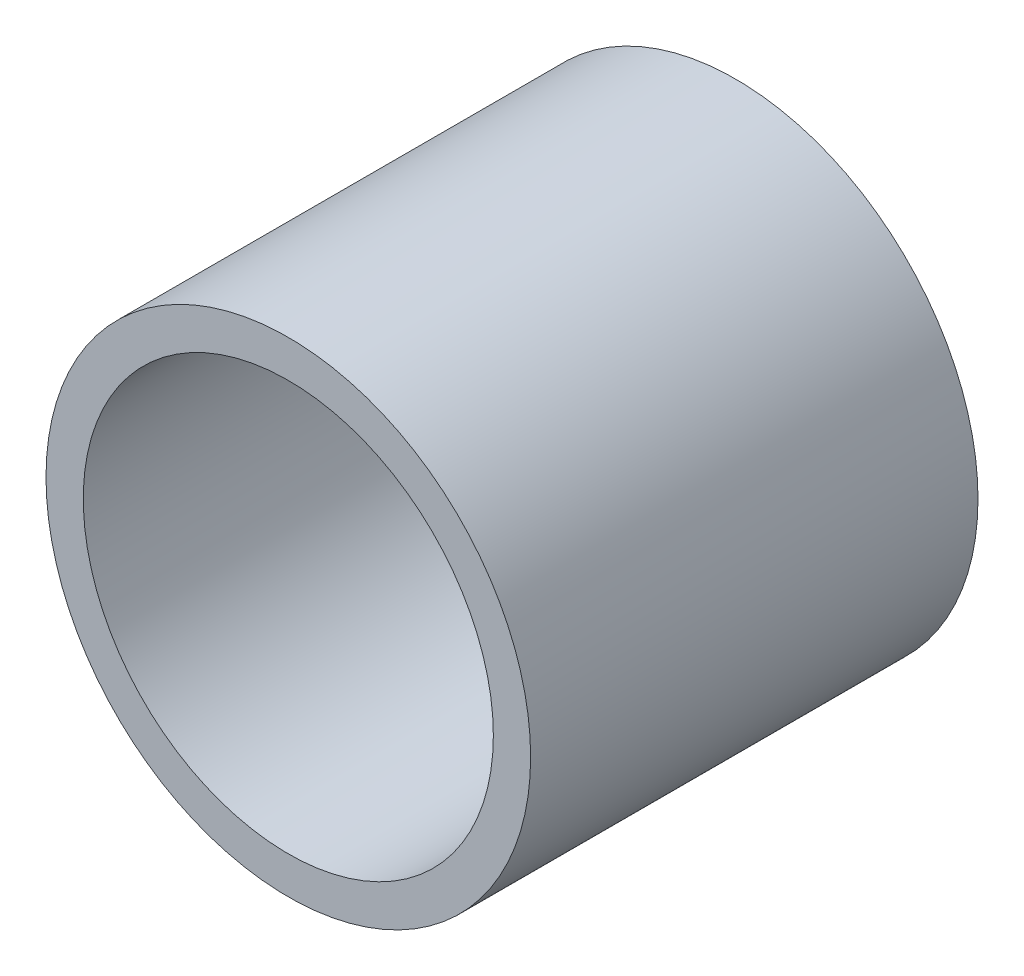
ISO-10303-21;
HEADER;
FILE_DESCRIPTION(('STEP AP214'),'2;1');
FILE_NAME('part.step','',(''),(''),'','','');
FILE_SCHEMA(('AUTOMOTIVE_DESIGN { 1 0 10303 214 1 1 1 1 }'));
ENDSEC;
DATA;
#1=APPLICATION_CONTEXT('core data for automotive mechanical design processes');
#2=APPLICATION_PROTOCOL_DEFINITION('international standard','automotive_design',2000,#1);
#3=PRODUCT_CONTEXT('',#1,'mechanical');
#4=PRODUCT('Part','Part','',(#3));
#5=PRODUCT_RELATED_PRODUCT_CATEGORY('part','',(#4));
#6=PRODUCT_DEFINITION_FORMATION('','',#4);
#7=PRODUCT_DEFINITION_CONTEXT('part definition',#1,'design');
#8=PRODUCT_DEFINITION('design','',#6,#7);
#9=PRODUCT_DEFINITION_SHAPE('','',#8);
#10=(LENGTH_UNIT() NAMED_UNIT(*) SI_UNIT(.MILLI.,.METRE.));
#11=(NAMED_UNIT(*) PLANE_ANGLE_UNIT() SI_UNIT($,.RADIAN.));
#12=(NAMED_UNIT(*) SI_UNIT($,.STERADIAN.) SOLID_ANGLE_UNIT());
#13=UNCERTAINTY_MEASURE_WITH_UNIT(LENGTH_MEASURE(1.E-05),#10,'distance_accuracy_value','');
#14=(GEOMETRIC_REPRESENTATION_CONTEXT(3) GLOBAL_UNCERTAINTY_ASSIGNED_CONTEXT((#13)) GLOBAL_UNIT_ASSIGNED_CONTEXT((#10,
#11,#12)) REPRESENTATION_CONTEXT('',''));
#15=CARTESIAN_POINT('',(0.,0.,0.));
#16=DIRECTION('',(0.,0.,1.));
#17=DIRECTION('',(1.,0.,0.));
#18=AXIS2_PLACEMENT_3D('',#15,#16,#17);
#19=CARTESIAN_POINT('',(0.,0.,24.));
#20=DIRECTION('',(0.,0.,1.));
#21=DIRECTION('',(1.,0.,0.));
#22=AXIS2_PLACEMENT_3D('',#19,#20,#21);
#23=PLANE('',#22);
#24=CARTESIAN_POINT('',(0.,0.,24.));
#25=DIRECTION('',(0.,0.,1.));
#26=DIRECTION('',(1.,0.,0.));
#27=AXIS2_PLACEMENT_3D('',#24,#25,#26);
#28=CIRCLE('',#27,13.);
#29=CARTESIAN_POINT('',(13.,0.,24.));
#30=VERTEX_POINT('',#29);
#31=EDGE_CURVE('E40',#30,#30,#28,.T.);
#32=ORIENTED_EDGE('',*,*,#31,.T.);
#33=EDGE_LOOP('',(#32));
#34=FACE_BOUND('',#33,.T.);
#35=CARTESIAN_POINT('',(0.,0.,24.));
#36=DIRECTION('',(0.,0.,1.));
#37=DIRECTION('',(1.,0.,0.));
#38=AXIS2_PLACEMENT_3D('',#35,#36,#37);
#39=CIRCLE('',#38,11.);
#40=CARTESIAN_POINT('',(11.,0.,24.));
#41=VERTEX_POINT('',#40);
#42=EDGE_CURVE('E48',#41,#41,#39,.T.);
#43=ORIENTED_EDGE('',*,*,#42,.F.);
#44=EDGE_LOOP('',(#43));
#45=FACE_BOUND('',#44,.T.);
#46=ADVANCED_FACE('F29',(#34,#45),#23,.T.);
#47=CARTESIAN_POINT('',(0.,0.,0.));
#48=DIRECTION('',(0.,0.,1.));
#49=DIRECTION('',(1.,0.,0.));
#50=AXIS2_PLACEMENT_3D('',#47,#48,#49);
#51=PLANE('',#50);
#52=CARTESIAN_POINT('',(0.,0.,0.));
#53=DIRECTION('',(0.,0.,1.));
#54=DIRECTION('',(1.,0.,0.));
#55=AXIS2_PLACEMENT_3D('',#52,#53,#54);
#56=CIRCLE('',#55,12.);
#57=CARTESIAN_POINT('',(12.,0.,0.));
#58=VERTEX_POINT('',#57);
#59=EDGE_CURVE('E36',#58,#58,#56,.T.);
#60=ORIENTED_EDGE('',*,*,#59,.T.);
#61=EDGE_LOOP('',(#60));
#62=FACE_BOUND('',#61,.T.);
#63=CARTESIAN_POINT('',(0.,0.,0.));
#64=DIRECTION('',(0.,0.,1.));
#65=DIRECTION('',(1.,0.,0.));
#66=AXIS2_PLACEMENT_3D('',#63,#64,#65);
#67=CIRCLE('',#66,13.);
#68=CARTESIAN_POINT('',(13.,0.,0.));
#69=VERTEX_POINT('',#68);
#70=EDGE_CURVE('E44',#69,#69,#67,.T.);
#71=ORIENTED_EDGE('',*,*,#70,.F.);
#72=EDGE_LOOP('',(#71));
#73=FACE_BOUND('',#72,.T.);
#74=ADVANCED_FACE('F56',(#62,#73),#51,.F.);
#75=CARTESIAN_POINT('',(0.,0.,24.));
#76=DIRECTION('',(0.,0.,-1.));
#77=DIRECTION('',(-1.,0.,0.));
#78=AXIS2_PLACEMENT_3D('',#75,#76,#77);
#79=CYLINDRICAL_SURFACE('',#78,13.);
#80=ORIENTED_EDGE('',*,*,#31,.F.);
#81=EDGE_LOOP('',(#80));
#82=FACE_BOUND('',#81,.T.);
#83=ORIENTED_EDGE('',*,*,#70,.T.);
#84=EDGE_LOOP('',(#83));
#85=FACE_BOUND('',#84,.T.);
#86=ADVANCED_FACE('F62',(#82,#85),#79,.T.);
#87=CARTESIAN_POINT('',(0.,0.,24.));
#88=DIRECTION('',(0.,0.,-1.));
#89=DIRECTION('',(-1.,0.,0.));
#90=AXIS2_PLACEMENT_3D('',#87,#88,#89);
#91=CYLINDRICAL_SURFACE('',#90,11.);
#92=CARTESIAN_POINT('',(0.,0.,1.00000000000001));
#93=DIRECTION('',(0.,0.,1.));
#94=DIRECTION('',(1.,0.,0.));
#95=AXIS2_PLACEMENT_3D('',#92,#93,#94);
#96=CIRCLE('',#95,11.);
#97=CARTESIAN_POINT('',(11.,0.,1.00000000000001));
#98=VERTEX_POINT('',#97);
#99=EDGE_CURVE('E10',#98,#98,#96,.F.);
#100=ORIENTED_EDGE('',*,*,#99,.T.);
#101=EDGE_LOOP('',(#100));
#102=FACE_BOUND('',#101,.T.);
#103=ORIENTED_EDGE('',*,*,#42,.T.);
#104=EDGE_LOOP('',(#103));
#105=FACE_BOUND('',#104,.T.);
#106=ADVANCED_FACE('F53',(#102,#105),#91,.F.);
#107=CARTESIAN_POINT('',(0.,0.,0.));
#108=DIRECTION('',(0.,0.,-1.));
#109=DIRECTION('',(-1.,0.,0.));
#110=AXIS2_PLACEMENT_3D('',#107,#108,#109);
#111=CONICAL_SURFACE('',#110,12.,0.785398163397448);
#112=ORIENTED_EDGE('',*,*,#99,.F.);
#113=EDGE_LOOP('',(#112));
#114=FACE_BOUND('',#113,.T.);
#115=ORIENTED_EDGE('',*,*,#59,.F.);
#116=EDGE_LOOP('',(#115));
#117=FACE_BOUND('',#116,.T.);
#118=ADVANCED_FACE('F31',(#114,#117),#111,.F.);
#119=CLOSED_SHELL('',(#46,#74,#86,#106,#118));
#120=MANIFOLD_SOLID_BREP('B2',#119);
#121=ADVANCED_BREP_SHAPE_REPRESENTATION('',(#18,#120),#14);
#122=SHAPE_DEFINITION_REPRESENTATION(#9,#121);
ENDSEC;
END-ISO-10303-21;
